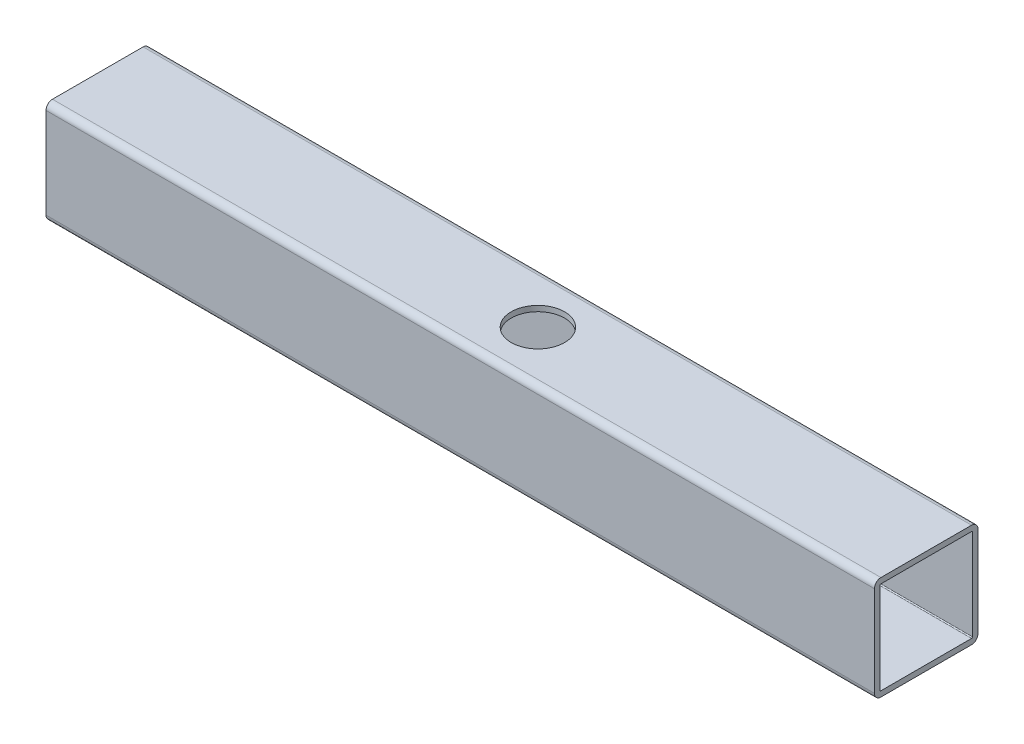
from build123d import *

# Parameters (mm, degrees)
EXTRUDE1_DEPTH     = 203.2
SKETCH2_R          = 6.5484375
CUT_EXTRUDE1_DEPTH = 206.609858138


with BuildPart() as part:
    # Sketch1 → Extrude1 (new body)
    with BuildSketch(Plane(origin=(0, 0, 0), x_dir=(0, 0, -1), z_dir=(1, 0, 0))):
        with BuildLine():
            Line((-5.373037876, 5.244240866), (16.851962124, 5.244240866))
            ThreePointArc((16.851962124, 5.244240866), (17.974494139, 4.779272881), (18.439462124, 3.656740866))
            Line((18.439462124, 3.656740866), (18.439462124, -18.568259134))
            ThreePointArc((18.439462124, -18.568259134), (17.974494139, -19.690791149), (16.851962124, -20.155759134))
            Line((16.851962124, -20.155759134), (-5.373037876, -20.155759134))
            ThreePointArc((-5.373037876, -20.155759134), (-6.495569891, -19.690791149), (-6.960537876, -18.568259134))
            Line((-6.960537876, -18.568259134), (-6.960537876, 3.656740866))
            ThreePointArc((-6.960537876, 3.656740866), (-6.495569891, 4.779272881), (-5.373037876, 5.244240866))
        make_face()
        with BuildLine():
            Line((-5.373037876, 3.898040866), (16.851962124, 3.898040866))
            ThreePointArc((16.851962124, 3.898040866), (17.02258699, 3.827365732), (17.093262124, 3.656740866))
            Line((17.093262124, 3.656740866), (17.093262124, -18.568259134))
            ThreePointArc((17.093262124, -18.568259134), (17.02258699, -18.738884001), (16.851962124, -18.809559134))
            Line((16.851962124, -18.809559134), (-5.373037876, -18.809559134))
            ThreePointArc((-5.373037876, -18.809559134), (-5.543662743, -18.738884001), (-5.614337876, -18.568259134))
            Line((-5.614337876, -18.568259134), (-5.614337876, 3.656740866))
            ThreePointArc((-5.614337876, 3.656740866), (-5.543662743, 3.827365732), (-5.373037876, 3.898040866))
        make_face(mode=Mode.SUBTRACT)
    extrude(amount=EXTRUDE1_DEPTH)

    # Sketch2 → Cut-Extrude1 (cut, through all)
    with BuildSketch(Plane.XZ.offset(20.155759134)):
        with Locations(Location((107.95, -5.739462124, 0), (0, 0, 270))):
            Circle(SKETCH2_R)
    extrude(amount=-CUT_EXTRUDE1_DEPTH, mode=Mode.SUBTRACT)


solid = part.part
